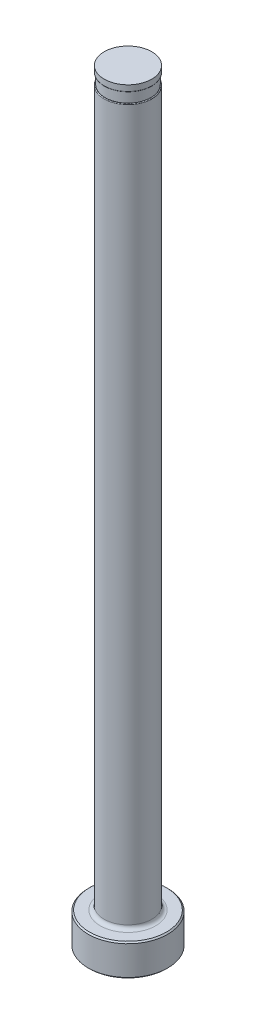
ISO-10303-21;
HEADER;
FILE_DESCRIPTION(('STEP AP214'),'2;1');
FILE_NAME('part.step','',(''),(''),'','','');
FILE_SCHEMA(('AUTOMOTIVE_DESIGN { 1 0 10303 214 1 1 1 1 }'));
ENDSEC;
DATA;
#1=APPLICATION_CONTEXT('core data for automotive mechanical design processes');
#2=APPLICATION_PROTOCOL_DEFINITION('international standard','automotive_design',2000,#1);
#3=PRODUCT_CONTEXT('',#1,'mechanical');
#4=PRODUCT('Part','Part','',(#3));
#5=PRODUCT_RELATED_PRODUCT_CATEGORY('part','',(#4));
#6=PRODUCT_DEFINITION_FORMATION('','',#4);
#7=PRODUCT_DEFINITION_CONTEXT('part definition',#1,'design');
#8=PRODUCT_DEFINITION('design','',#6,#7);
#9=PRODUCT_DEFINITION_SHAPE('','',#8);
#10=(LENGTH_UNIT() NAMED_UNIT(*) SI_UNIT(.MILLI.,.METRE.));
#11=(NAMED_UNIT(*) PLANE_ANGLE_UNIT() SI_UNIT($,.RADIAN.));
#12=(NAMED_UNIT(*) SI_UNIT($,.STERADIAN.) SOLID_ANGLE_UNIT());
#13=UNCERTAINTY_MEASURE_WITH_UNIT(LENGTH_MEASURE(1.E-05),#10,'distance_accuracy_value','');
#14=(GEOMETRIC_REPRESENTATION_CONTEXT(3) GLOBAL_UNCERTAINTY_ASSIGNED_CONTEXT((#13)) GLOBAL_UNIT_ASSIGNED_CONTEXT((#10,
#11,#12)) REPRESENTATION_CONTEXT('',''));
#15=CARTESIAN_POINT('',(0.,0.,0.));
#16=DIRECTION('',(0.,0.,1.));
#17=DIRECTION('',(1.,0.,0.));
#18=AXIS2_PLACEMENT_3D('',#15,#16,#17);
#19=CARTESIAN_POINT('',(-4.76249999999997,151.13,0.));
#20=DIRECTION('',(0.,1.,0.));
#21=DIRECTION('',(0.,0.,1.));
#22=AXIS2_PLACEMENT_3D('',#19,#20,#21);
#23=PLANE('',#22);
#24=CARTESIAN_POINT('',(0.,151.13,0.));
#25=DIRECTION('',(0.,1.,0.));
#26=DIRECTION('',(0.,0.,1.));
#27=AXIS2_PLACEMENT_3D('',#24,#25,#26);
#28=CIRCLE('',#27,4.62279999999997);
#29=CARTESIAN_POINT('',(0.,151.13,4.62279999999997));
#30=VERTEX_POINT('',#29);
#31=EDGE_CURVE('E11',#30,#30,#28,.F.);
#32=ORIENTED_EDGE('',*,*,#31,.T.);
#33=EDGE_LOOP('',(#32));
#34=FACE_BOUND('',#33,.T.);
#35=CARTESIAN_POINT('',(0.,151.13,0.));
#36=DIRECTION('',(0.,1.,0.));
#37=DIRECTION('',(0.,0.,1.));
#38=AXIS2_PLACEMENT_3D('',#35,#36,#37);
#39=CIRCLE('',#38,4.55929999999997);
#40=CARTESIAN_POINT('',(0.,151.13,4.55929999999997));
#41=VERTEX_POINT('',#40);
#42=EDGE_CURVE('E78',#41,#41,#39,.T.);
#43=ORIENTED_EDGE('',*,*,#42,.T.);
#44=EDGE_LOOP('',(#43));
#45=FACE_BOUND('',#44,.T.);
#46=ADVANCED_FACE('F36',(#34,#45),#23,.F.);
#47=CARTESIAN_POINT('',(0.,259.958771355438,0.));
#48=DIRECTION('',(0.,1.,0.));
#49=DIRECTION('',(0.,0.,1.));
#50=AXIS2_PLACEMENT_3D('',#47,#48,#49);
#51=CYLINDRICAL_SURFACE('',#50,4.76249999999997);
#52=DIRECTION('',(0.,1.,0.));
#53=VECTOR('',#52,1.);
#54=CARTESIAN_POINT('',(-4.55929999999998,259.958771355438,-1.37629566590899));
#55=LINE('',#54,#53);
#56=CARTESIAN_POINT('',(-4.55929999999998,148.971,-1.37629566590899));
#57=VERTEX_POINT('',#56);
#58=CARTESIAN_POINT('',(-4.55929999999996,86.614,-1.37629566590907));
#59=VERTEX_POINT('',#58);
#60=EDGE_CURVE('E73',#57,#59,#55,.F.);
#61=ORIENTED_EDGE('',*,*,#60,.F.);
#62=CARTESIAN_POINT('',(0.,148.971,0.));
#63=DIRECTION('',(0.,-1.,0.));
#64=DIRECTION('',(0.,0.,-1.));
#65=AXIS2_PLACEMENT_3D('',#62,#63,#64);
#66=CIRCLE('',#65,4.76249999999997);
#67=CARTESIAN_POINT('',(-4.55929999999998,148.971,1.37629566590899));
#68=VERTEX_POINT('',#67);
#69=EDGE_CURVE('E51',#57,#68,#66,.T.);
#70=ORIENTED_EDGE('',*,*,#69,.T.);
#71=DIRECTION('',(0.,1.,0.));
#72=VECTOR('',#71,1.);
#73=CARTESIAN_POINT('',(-4.55929999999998,259.958771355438,1.37629566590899));
#74=LINE('',#73,#72);
#75=CARTESIAN_POINT('',(-4.55929999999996,86.614,1.37629566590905));
#76=VERTEX_POINT('',#75);
#77=EDGE_CURVE('E84',#76,#68,#74,.T.);
#78=ORIENTED_EDGE('',*,*,#77,.F.);
#79=CARTESIAN_POINT('',(-4.55929999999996,86.614,-1.37629566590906));
#80=CARTESIAN_POINT('',(-4.55929737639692,86.5852402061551,-1.37629775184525));
#81=CARTESIAN_POINT('',(-4.55969127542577,86.5564975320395,-1.37500007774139));
#82=CARTESIAN_POINT('',(-4.56124470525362,86.4992773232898,-1.36984087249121));
#83=CARTESIAN_POINT('',(-4.5624038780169,86.4707996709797,-1.36598054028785));
#84=CARTESIAN_POINT('',(-4.56696801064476,86.3864539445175,-1.35067685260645));
#85=CARTESIAN_POINT('',(-4.5714603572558,86.3312762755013,-1.33550964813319));
#86=CARTESIAN_POINT('',(-4.58280020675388,86.2246988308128,-1.29605614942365));
#87=CARTESIAN_POINT('',(-4.58964466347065,86.1732942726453,-1.27178164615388));
#88=CARTESIAN_POINT('',(-4.60493832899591,86.0753127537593,-1.2152383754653));
#89=CARTESIAN_POINT('',(-4.61338924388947,86.0287410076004,-1.18296109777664));
#90=CARTESIAN_POINT('',(-4.63119432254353,85.9406407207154,-1.11122717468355));
#91=CARTESIAN_POINT('',(-4.64055936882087,85.8991909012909,-1.07167734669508));
#92=CARTESIAN_POINT('',(-4.65929799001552,85.8224511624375,-0.987030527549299));
#93=CARTESIAN_POINT('',(-4.66867156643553,85.7871627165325,-0.941932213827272));
#94=CARTESIAN_POINT('',(-4.68829944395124,85.7173161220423,-0.839298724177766));
#95=CARTESIAN_POINT('',(-4.69843056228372,85.6839130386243,-0.780955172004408));
#96=CARTESIAN_POINT('',(-4.71694909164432,85.6254876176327,-0.659965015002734));
#97=CARTESIAN_POINT('',(-4.72533534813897,85.6004708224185,-0.597315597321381));
#98=CARTESIAN_POINT('',(-4.74110178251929,85.5547147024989,-0.457354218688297));
#99=CARTESIAN_POINT('',(-4.74801655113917,85.5355974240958,-0.379457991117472));
#100=CARTESIAN_POINT('',(-4.75800499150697,85.5083334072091,-0.221524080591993));
#101=CARTESIAN_POINT('',(-4.76107621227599,85.500193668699,-0.141485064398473));
#102=CARTESIAN_POINT('',(-4.76327668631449,85.4943271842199,0.0299431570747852));
#103=CARTESIAN_POINT('',(-4.76181415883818,85.4981641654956,0.121398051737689));
#104=CARTESIAN_POINT('',(-4.75374911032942,85.5198915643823,0.302489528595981));
#105=CARTESIAN_POINT('',(-4.74714208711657,85.5377942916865,0.392124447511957));
#106=CARTESIAN_POINT('',(-4.72930079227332,85.5886459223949,0.568426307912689));
#107=CARTESIAN_POINT('',(-4.71798291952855,85.6218679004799,0.655007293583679));
#108=CARTESIAN_POINT('',(-4.69215822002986,85.7041393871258,0.819736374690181));
#109=CARTESIAN_POINT('',(-4.67765906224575,85.7531509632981,0.897904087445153));
#110=CARTESIAN_POINT('',(-4.65260917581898,85.8488873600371,1.01840460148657));
#111=CARTESIAN_POINT('',(-4.642278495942,85.8913315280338,1.06420330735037));
#112=CARTESIAN_POINT('',(-4.62221244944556,85.9833278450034,1.14822353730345));
#113=CARTESIAN_POINT('',(-4.61247679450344,86.0328765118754,1.18644875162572));
#114=CARTESIAN_POINT('',(-4.59462030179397,86.1386759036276,1.2538357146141));
#115=CARTESIAN_POINT('',(-4.58651300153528,86.1949770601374,1.28292253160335));
#116=CARTESIAN_POINT('',(-4.57311393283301,86.312357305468,1.3299034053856));
#117=CARTESIAN_POINT('',(-4.56781667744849,86.373426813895,1.34781928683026));
#118=CARTESIAN_POINT('',(-4.56265822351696,86.4650432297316,1.36513201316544));
#119=CARTESIAN_POINT('',(-4.5614036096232,86.4946738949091,1.36931216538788));
#120=CARTESIAN_POINT('',(-4.55972347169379,86.5541961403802,1.37489368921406));
#121=CARTESIAN_POINT('',(-4.55929732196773,86.584087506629,1.37629715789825));
#122=CARTESIAN_POINT('',(-4.55929999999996,86.614,1.37629566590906));
#123=B_SPLINE_CURVE_WITH_KNOTS('',3,(#79,#80,#81,#82,#83,#84,#85,#86,#87,#88,#89,#90,#91,#92,
#93,#94,#95,#96,#97,#98,#99,#100,#101,#102,#103,#104,#105,#106,#107,#108,#109,#110,#111,#112,
#113,#114,#115,#116,#117,#118,#119,#120,#121,#122),.UNSPECIFIED.,.F.,.F.,(4,2,2,2,2,2,2,2,2,2,2,
2,2,2,2,2,2,2,2,2,2,4),(0.,0.086214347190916,0.172388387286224,0.343564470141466,
0.514519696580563,0.685657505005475,0.859163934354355,1.03271180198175,1.23591349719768,
1.43924922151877,1.67981780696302,1.92053972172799,2.1939427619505,2.4675853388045,
2.74630643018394,3.02436286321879,3.21350217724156,3.40254910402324,3.59310796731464,
3.78329335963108,3.87302183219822,3.9626825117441),.UNSPECIFIED.);
#124=EDGE_CURVE('E81',#59,#76,#123,.T.);
#125=ORIENTED_EDGE('',*,*,#124,.F.);
#126=EDGE_LOOP('',(#61,#70,#78,#125));
#127=FACE_BOUND('',#126,.T.);
#128=CARTESIAN_POINT('',(0.,7.11200000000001,0.));
#129=DIRECTION('',(0.,1.,0.));
#130=DIRECTION('',(0.,0.,1.));
#131=AXIS2_PLACEMENT_3D('',#128,#129,#130);
#132=CIRCLE('',#131,4.76249999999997);
#133=CARTESIAN_POINT('',(0.,7.11200000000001,4.76249999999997));
#134=VERTEX_POINT('',#133);
#135=EDGE_CURVE('E116',#134,#134,#132,.T.);
#136=ORIENTED_EDGE('',*,*,#135,.T.);
#137=EDGE_LOOP('',(#136));
#138=FACE_BOUND('',#137,.T.);
#139=ADVANCED_FACE('F82',(#127,#138),#51,.T.);
#140=CARTESIAN_POINT('',(0.,0.,0.));
#141=DIRECTION('',(0.,-1.,0.));
#142=DIRECTION('',(0.,0.,-1.));
#143=AXIS2_PLACEMENT_3D('',#140,#141,#142);
#144=PLANE('',#143);
#145=CARTESIAN_POINT('',(0.,0.,0.));
#146=DIRECTION('',(0.,-1.,0.));
#147=DIRECTION('',(0.,0.,-1.));
#148=AXIS2_PLACEMENT_3D('',#145,#146,#147);
#149=CIRCLE('',#148,7.68349999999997);
#150=CARTESIAN_POINT('',(0.,0.,-7.68349999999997));
#151=VERTEX_POINT('',#150);
#152=EDGE_CURVE('E113',#151,#151,#149,.T.);
#153=ORIENTED_EDGE('',*,*,#152,.T.);
#154=EDGE_LOOP('',(#153));
#155=FACE_BOUND('',#154,.T.);
#156=ADVANCED_FACE('F192',(#155),#144,.T.);
#157=CARTESIAN_POINT('',(0.,259.958771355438,0.));
#158=DIRECTION('',(0.,1.,0.));
#159=DIRECTION('',(0.,0.,1.));
#160=AXIS2_PLACEMENT_3D('',#157,#158,#159);
#161=CYLINDRICAL_SURFACE('',#160,7.93749999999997);
#162=CARTESIAN_POINT('',(0.,6.09600000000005,0.));
#163=DIRECTION('',(0.,1.,0.));
#164=DIRECTION('',(0.,0.,1.));
#165=AXIS2_PLACEMENT_3D('',#162,#163,#164);
#166=CIRCLE('',#165,7.93749999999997);
#167=CARTESIAN_POINT('',(0.,6.09600000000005,7.93749999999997));
#168=VERTEX_POINT('',#167);
#169=EDGE_CURVE('E110',#168,#168,#166,.F.);
#170=ORIENTED_EDGE('',*,*,#169,.T.);
#171=EDGE_LOOP('',(#170));
#172=FACE_BOUND('',#171,.T.);
#173=CARTESIAN_POINT('',(0.,0.253999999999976,0.));
#174=DIRECTION('',(0.,-1.,0.));
#175=DIRECTION('',(0.,0.,-1.));
#176=AXIS2_PLACEMENT_3D('',#173,#174,#175);
#177=CIRCLE('',#176,7.93749999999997);
#178=CARTESIAN_POINT('',(0.,0.253999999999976,-7.93749999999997));
#179=VERTEX_POINT('',#178);
#180=EDGE_CURVE('E107',#179,#179,#177,.F.);
#181=ORIENTED_EDGE('',*,*,#180,.T.);
#182=EDGE_LOOP('',(#181));
#183=FACE_BOUND('',#182,.T.);
#184=ADVANCED_FACE('F195',(#172,#183),#161,.T.);
#185=CARTESIAN_POINT('',(-7.93749999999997,6.35,0.));
#186=DIRECTION('',(0.,1.,0.));
#187=DIRECTION('',(0.,0.,1.));
#188=AXIS2_PLACEMENT_3D('',#185,#186,#187);
#189=PLANE('',#188);
#190=CARTESIAN_POINT('',(0.,6.35,0.));
#191=DIRECTION('',(0.,1.,0.));
#192=DIRECTION('',(0.,0.,1.));
#193=AXIS2_PLACEMENT_3D('',#190,#191,#192);
#194=CIRCLE('',#193,5.52449999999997);
#195=CARTESIAN_POINT('',(0.,6.35,5.52449999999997));
#196=VERTEX_POINT('',#195);
#197=EDGE_CURVE('E87',#196,#196,#194,.F.);
#198=ORIENTED_EDGE('',*,*,#197,.T.);
#199=EDGE_LOOP('',(#198));
#200=FACE_BOUND('',#199,.T.);
#201=CARTESIAN_POINT('',(0.,6.35,0.));
#202=DIRECTION('',(0.,1.,0.));
#203=DIRECTION('',(0.,0.,1.));
#204=AXIS2_PLACEMENT_3D('',#201,#202,#203);
#205=CIRCLE('',#204,7.68350000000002);
#206=CARTESIAN_POINT('',(0.,6.35,7.68350000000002));
#207=VERTEX_POINT('',#206);
#208=EDGE_CURVE('E104',#207,#207,#205,.T.);
#209=ORIENTED_EDGE('',*,*,#208,.T.);
#210=EDGE_LOOP('',(#209));
#211=FACE_BOUND('',#210,.T.);
#212=ADVANCED_FACE('F190',(#200,#211),#189,.T.);
#213=CARTESIAN_POINT('',(0.,6.35000000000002,0.));
#214=DIRECTION('',(0.,-1.,0.));
#215=DIRECTION('',(0.,0.,-1.));
#216=AXIS2_PLACEMENT_3D('',#213,#214,#215);
#217=CONICAL_SURFACE('',#216,7.6835,0.785398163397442);
#218=ORIENTED_EDGE('',*,*,#169,.F.);
#219=EDGE_LOOP('',(#218));
#220=FACE_BOUND('',#219,.T.);
#221=ORIENTED_EDGE('',*,*,#208,.F.);
#222=EDGE_LOOP('',(#221));
#223=FACE_BOUND('',#222,.T.);
#224=ADVANCED_FACE('F186',(#220,#223),#217,.T.);
#225=CARTESIAN_POINT('',(0.,0.253999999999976,0.));
#226=DIRECTION('',(0.,1.,0.));
#227=DIRECTION('',(0.,0.,1.));
#228=AXIS2_PLACEMENT_3D('',#225,#226,#227);
#229=CONICAL_SURFACE('',#228,7.93749999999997,0.785398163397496);
#230=ORIENTED_EDGE('',*,*,#152,.F.);
#231=EDGE_LOOP('',(#230));
#232=FACE_BOUND('',#231,.T.);
#233=ORIENTED_EDGE('',*,*,#180,.F.);
#234=EDGE_LOOP('',(#233));
#235=FACE_BOUND('',#234,.T.);
#236=ADVANCED_FACE('F182',(#232,#235),#229,.T.);
#237=CARTESIAN_POINT('',(0.,7.11200000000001,0.));
#238=DIRECTION('',(0.,1.,0.));
#239=DIRECTION('',(0.,0.,1.));
#240=AXIS2_PLACEMENT_3D('',#237,#238,#239);
#241=TOROIDAL_SURFACE('',#240,5.52449999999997,0.762);
#242=ORIENTED_EDGE('',*,*,#197,.F.);
#243=EDGE_LOOP('',(#242));
#244=FACE_BOUND('',#243,.T.);
#245=ORIENTED_EDGE('',*,*,#135,.F.);
#246=EDGE_LOOP('',(#245));
#247=FACE_BOUND('',#246,.T.);
#248=ADVANCED_FACE('F147',(#244,#247),#241,.F.);
#249=CARTESIAN_POINT('',(-4.76249999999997,149.098,0.));
#250=DIRECTION('',(0.,-1.,0.));
#251=DIRECTION('',(0.,0.,-1.));
#252=AXIS2_PLACEMENT_3D('',#249,#250,#251);
#253=PLANE('',#252);
#254=DIRECTION('',(0.,0.,1.));
#255=VECTOR('',#254,1.);
#256=CARTESIAN_POINT('',(-4.55929999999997,149.098,0.));
#257=LINE('',#256,#255);
#258=CARTESIAN_POINT('',(-4.55929999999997,149.098,0.));
#259=VERTEX_POINT('',#258);
#260=CARTESIAN_POINT('',(-4.55929999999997,149.098,0.837044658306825));
#261=VERTEX_POINT('',#260);
#262=EDGE_CURVE('E90',#259,#261,#257,.T.);
#263=ORIENTED_EDGE('',*,*,#262,.T.);
#264=CARTESIAN_POINT('',(0.,149.098,0.));
#265=DIRECTION('',(0.,-1.,0.));
#266=DIRECTION('',(0.,0.,-1.));
#267=AXIS2_PLACEMENT_3D('',#264,#265,#266);
#268=CIRCLE('',#267,4.63549999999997);
#269=CARTESIAN_POINT('',(-4.55929999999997,149.098,-0.837044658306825));
#270=VERTEX_POINT('',#269);
#271=EDGE_CURVE('E86',#261,#270,#268,.F.);
#272=ORIENTED_EDGE('',*,*,#271,.T.);
#273=EDGE_CURVE('E79',#270,#259,#257,.T.);
#274=ORIENTED_EDGE('',*,*,#273,.T.);
#275=CARTESIAN_POINT('',(0.,149.098,0.));
#276=DIRECTION('',(0.,1.,0.));
#277=DIRECTION('',(0.,0.,1.));
#278=AXIS2_PLACEMENT_3D('',#275,#276,#277);
#279=CIRCLE('',#278,4.55929999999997);
#280=EDGE_CURVE('E101',#259,#259,#279,.T.);
#281=ORIENTED_EDGE('',*,*,#280,.F.);
#282=EDGE_LOOP('',(#263,#272,#274,#281));
#283=FACE_BOUND('',#282,.T.);
#284=ADVANCED_FACE('F144',(#283),#253,.F.);
#285=CARTESIAN_POINT('',(0.,153.448281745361,0.));
#286=DIRECTION('',(0.,1.,0.));
#287=DIRECTION('',(0.,0.,1.));
#288=AXIS2_PLACEMENT_3D('',#285,#286,#287);
#289=CYLINDRICAL_SURFACE('',#288,4.55929999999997);
#290=ORIENTED_EDGE('',*,*,#42,.F.);
#291=EDGE_LOOP('',(#290));
#292=FACE_BOUND('',#291,.T.);
#293=ORIENTED_EDGE('',*,*,#280,.T.);
#294=EDGE_LOOP('',(#293));
#295=FACE_BOUND('',#294,.T.);
#296=ADVANCED_FACE('F141',(#292,#295),#289,.T.);
#297=CARTESIAN_POINT('',(-4.55929999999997,150.114,-7.93749999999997));
#298=DIRECTION('',(1.,0.,0.));
#299=DIRECTION('',(0.,1.,0.));
#300=AXIS2_PLACEMENT_3D('',#297,#298,#299);
#301=PLANE('',#300);
#302=ORIENTED_EDGE('',*,*,#273,.F.);
#303=CARTESIAN_POINT('',(-4.55929999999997,149.098,-0.837044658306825));
#304=CARTESIAN_POINT('',(-4.55929999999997,149.097996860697,-0.858041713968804));
#305=CARTESIAN_POINT('',(-4.55929999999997,149.097829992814,-0.879040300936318));
#306=CARTESIAN_POINT('',(-4.55929999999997,149.097073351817,-0.921044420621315));
#307=CARTESIAN_POINT('',(-4.55929999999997,149.096483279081,-0.942049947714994));
#308=CARTESIAN_POINT('',(-4.55929999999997,149.094769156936,-0.984421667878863));
#309=CARTESIAN_POINT('',(-4.55929999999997,149.093635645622,-1.00578751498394));
#310=CARTESIAN_POINT('',(-4.55929999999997,149.090687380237,-1.04846310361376));
#311=CARTESIAN_POINT('',(-4.55929999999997,149.088872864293,-1.06977286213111));
#312=CARTESIAN_POINT('',(-4.55929999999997,149.083360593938,-1.12201635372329));
#313=CARTESIAN_POINT('',(-4.55929999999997,149.079181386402,-1.15290757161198));
#314=CARTESIAN_POINT('',(-4.55929999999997,149.070757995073,-1.19875333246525));
#315=CARTESIAN_POINT('',(-4.55929999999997,149.067604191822,-1.21390713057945));
#316=CARTESIAN_POINT('',(-4.55929999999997,149.06032624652,-1.24397628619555));
#317=CARTESIAN_POINT('',(-4.55929999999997,149.056203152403,-1.25889188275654));
#318=CARTESIAN_POINT('',(-4.55929999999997,149.049136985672,-1.28034672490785));
#319=CARTESIAN_POINT('',(-4.55929999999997,149.046754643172,-1.28707008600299));
#320=CARTESIAN_POINT('',(-4.55929999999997,149.041598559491,-1.30038917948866));
#321=CARTESIAN_POINT('',(-4.55929999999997,149.038823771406,-1.30698451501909));
#322=CARTESIAN_POINT('',(-4.55929999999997,149.032425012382,-1.32070015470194));
#323=CARTESIAN_POINT('',(-4.55929999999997,149.028739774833,-1.32779211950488));
#324=CARTESIAN_POINT('',(-4.55929999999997,149.020505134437,-1.34145187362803));
#325=CARTESIAN_POINT('',(-4.55929999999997,149.015959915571,-1.34802199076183));
#326=CARTESIAN_POINT('',(-4.55929999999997,149.008707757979,-1.3564128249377));
#327=CARTESIAN_POINT('',(-4.55929999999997,149.006550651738,-1.35870356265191));
#328=CARTESIAN_POINT('',(-4.55929999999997,149.001986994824,-1.36303580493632));
#329=CARTESIAN_POINT('',(-4.55929999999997,148.999580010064,-1.36507686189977));
#330=CARTESIAN_POINT('',(-4.55929999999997,148.994447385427,-1.36882028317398));
#331=CARTESIAN_POINT('',(-4.55929999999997,148.99171711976,-1.37051646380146));
#332=CARTESIAN_POINT('',(-4.55929999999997,148.985982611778,-1.37333747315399));
#333=CARTESIAN_POINT('',(-4.55929999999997,148.982980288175,-1.37446598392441));
#334=CARTESIAN_POINT('',(-4.55929999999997,148.978439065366,-1.37556999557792));
#335=CARTESIAN_POINT('',(-4.55929999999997,148.976969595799,-1.37583954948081));
#336=CARTESIAN_POINT('',(-4.55929999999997,148.974000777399,-1.37620343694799));
#337=CARTESIAN_POINT('',(-4.55929999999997,148.972501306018,-1.3762967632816));
#338=CARTESIAN_POINT('',(-4.55929999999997,148.971,-1.37629566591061));
#339=B_SPLINE_CURVE_WITH_KNOTS('',3,(#303,#304,#305,#306,#307,#308,#309,#310,#311,#312,#313,
#314,#315,#316,#317,#318,#319,#320,#321,#322,#323,#324,#325,#326,#327,#328,#329,#330,#331,#332,
#333,#334,#335,#336,#337,#338),.UNSPECIFIED.,.F.,.F.,(4,2,2,2,2,2,2,2,2,2,2,2,2,2,2,2,2,4),(0.,
0.0629926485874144,0.126029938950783,0.190207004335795,0.254361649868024,0.347770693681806,
0.394187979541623,0.440555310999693,0.461946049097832,0.483394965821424,0.507342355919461,
0.531176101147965,0.540601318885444,0.550043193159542,0.559641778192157,0.56917727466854,
0.573649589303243,0.578147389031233),.UNSPECIFIED.);
#340=EDGE_CURVE('E59',#270,#57,#339,.T.);
#341=ORIENTED_EDGE('',*,*,#340,.T.);
#342=ORIENTED_EDGE('',*,*,#60,.T.);
#343=DIRECTION('',(0.,0.,1.));
#344=VECTOR('',#343,1.);
#345=CARTESIAN_POINT('',(-4.55929999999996,86.614,-7.93749999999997));
#346=LINE('',#345,#344);
#347=EDGE_CURVE('E77',#59,#76,#346,.T.);
#348=ORIENTED_EDGE('',*,*,#347,.T.);
#349=ORIENTED_EDGE('',*,*,#77,.T.);
#350=CARTESIAN_POINT('',(-4.55929999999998,148.971,1.37629566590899));
#351=CARTESIAN_POINT('',(-4.55929999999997,148.973444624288,1.3763038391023));
#352=CARTESIAN_POINT('',(-4.55929999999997,148.975877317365,1.37605183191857));
#353=CARTESIAN_POINT('',(-4.55929999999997,148.980619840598,1.37510642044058));
#354=CARTESIAN_POINT('',(-4.55929999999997,148.982930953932,1.37441958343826));
#355=CARTESIAN_POINT('',(-4.55929999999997,148.987943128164,1.37247105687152));
#356=CARTESIAN_POINT('',(-4.55929999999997,148.990605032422,1.3711110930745));
#357=CARTESIAN_POINT('',(-4.55929999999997,148.995689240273,1.36798215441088));
#358=CARTESIAN_POINT('',(-4.55929999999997,148.998109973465,1.36621072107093));
#359=CARTESIAN_POINT('',(-4.55929999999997,149.004401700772,1.36098866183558));
#360=CARTESIAN_POINT('',(-4.55929999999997,149.0080371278,1.35725807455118));
#361=CARTESIAN_POINT('',(-4.55929999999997,149.014750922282,1.34933701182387));
#362=CARTESIAN_POINT('',(-4.55929999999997,149.017828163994,1.34514563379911));
#363=CARTESIAN_POINT('',(-4.55929999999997,149.029141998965,1.32813171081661));
#364=CARTESIAN_POINT('',(-4.55929999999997,149.035833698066,1.31430846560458));
#365=CARTESIAN_POINT('',(-4.55929999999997,149.047426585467,1.28593719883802));
#366=CARTESIAN_POINT('',(-4.55929999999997,149.052315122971,1.27138484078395));
#367=CARTESIAN_POINT('',(-4.55929999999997,149.060580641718,1.24300288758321));
#368=CARTESIAN_POINT('',(-4.55929999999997,149.064042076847,1.22919836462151));
#369=CARTESIAN_POINT('',(-4.55929999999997,149.070216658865,1.20142059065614));
#370=CARTESIAN_POINT('',(-4.55929999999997,149.072929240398,1.18744722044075));
#371=CARTESIAN_POINT('',(-4.55929999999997,149.080216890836,1.14532367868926));
#372=CARTESIAN_POINT('',(-4.55929999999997,149.08392779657,1.11702450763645));
#373=CARTESIAN_POINT('',(-4.55929999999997,149.089831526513,1.06027711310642));
#374=CARTESIAN_POINT('',(-4.55929999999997,149.092023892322,1.031828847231));
#375=CARTESIAN_POINT('',(-4.55929999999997,149.095305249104,0.974900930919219));
#376=CARTESIAN_POINT('',(-4.55929999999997,149.096395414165,0.946421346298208));
#377=CARTESIAN_POINT('',(-4.55929999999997,149.097399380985,0.904435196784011));
#378=CARTESIAN_POINT('',(-4.55929999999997,149.097630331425,0.890934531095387));
#379=CARTESIAN_POINT('',(-4.55929999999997,149.097930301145,0.863970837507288));
#380=CARTESIAN_POINT('',(-4.55929999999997,149.097999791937,0.85050781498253));
#381=CARTESIAN_POINT('',(-4.55929999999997,149.098,0.837044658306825));
#382=B_SPLINE_CURVE_WITH_KNOTS('',3,(#350,#351,#352,#353,#354,#355,#356,#357,#358,#359,#360,
#361,#362,#363,#364,#365,#366,#367,#368,#369,#370,#371,#372,#373,#374,#375,#376,#377,#378,#379,
#380,#381),.UNSPECIFIED.,.F.,.F.,(4,2,2,2,2,2,2,2,2,2,2,2,2,2,2,4),(0.,0.00730179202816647,
0.0144958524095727,0.0234127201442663,0.0323843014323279,0.0479233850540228,0.0634934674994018,
0.109206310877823,0.155234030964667,0.197892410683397,0.240582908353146,0.32613198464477,
0.411706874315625,0.497190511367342,0.537697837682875,0.578086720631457),.UNSPECIFIED.);
#383=EDGE_CURVE('E172',#68,#261,#382,.T.);
#384=ORIENTED_EDGE('',*,*,#383,.T.);
#385=ORIENTED_EDGE('',*,*,#262,.F.);
#386=EDGE_LOOP('',(#302,#341,#342,#348,#349,#384,#385));
#387=FACE_BOUND('',#386,.T.);
#388=ADVANCED_FACE('F75',(#387),#301,.F.);
#389=CARTESIAN_POINT('',(-7.73429999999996,86.614,-7.93749999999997));
#390=DIRECTION('',(0.,0.,1.));
#391=DIRECTION('',(1.,0.,0.));
#392=AXIS2_PLACEMENT_3D('',#389,#390,#391);
#393=CYLINDRICAL_SURFACE('',#392,3.175);
#394=ORIENTED_EDGE('',*,*,#347,.F.);
#395=ORIENTED_EDGE('',*,*,#124,.T.);
#396=EDGE_LOOP('',(#394,#395));
#397=FACE_BOUND('',#396,.T.);
#398=ADVANCED_FACE('F89',(#397),#393,.F.);
#399=CARTESIAN_POINT('',(0.,152.687735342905,0.));
#400=DIRECTION('',(0.,1.,0.));
#401=DIRECTION('',(0.,0.,1.));
#402=AXIS2_PLACEMENT_3D('',#399,#400,#401);
#403=CYLINDRICAL_SURFACE('',#402,4.74979999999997);
#404=CARTESIAN_POINT('',(0.,151.257,0.));
#405=DIRECTION('',(0.,1.,0.));
#406=DIRECTION('',(0.,0.,1.));
#407=AXIS2_PLACEMENT_3D('',#404,#405,#406);
#408=CIRCLE('',#407,4.74979999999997);
#409=CARTESIAN_POINT('',(0.,151.257,4.74979999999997));
#410=VERTEX_POINT('',#409);
#411=EDGE_CURVE('E44',#410,#410,#408,.T.);
#412=ORIENTED_EDGE('',*,*,#411,.T.);
#413=EDGE_LOOP('',(#412));
#414=FACE_BOUND('',#413,.T.);
#415=CARTESIAN_POINT('',(0.,152.4,0.));
#416=DIRECTION('',(0.,1.,0.));
#417=DIRECTION('',(0.,0.,1.));
#418=AXIS2_PLACEMENT_3D('',#415,#416,#417);
#419=CIRCLE('',#418,4.74979999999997);
#420=CARTESIAN_POINT('',(0.,152.4,4.74979999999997));
#421=VERTEX_POINT('',#420);
#422=EDGE_CURVE('E91',#421,#421,#419,.T.);
#423=ORIENTED_EDGE('',*,*,#422,.F.);
#424=EDGE_LOOP('',(#423));
#425=FACE_BOUND('',#424,.T.);
#426=ADVANCED_FACE('F135',(#414,#425),#403,.T.);
#427=CARTESIAN_POINT('',(-4.76249999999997,152.4,0.));
#428=DIRECTION('',(0.,1.,0.));
#429=DIRECTION('',(0.,0.,1.));
#430=AXIS2_PLACEMENT_3D('',#427,#428,#429);
#431=PLANE('',#430);
#432=ORIENTED_EDGE('',*,*,#422,.T.);
#433=EDGE_LOOP('',(#432));
#434=FACE_BOUND('',#433,.T.);
#435=ADVANCED_FACE('F149',(#434),#431,.T.);
#436=CARTESIAN_POINT('',(0.,148.971,0.));
#437=DIRECTION('',(0.,-1.,0.));
#438=DIRECTION('',(0.,0.,-1.));
#439=AXIS2_PLACEMENT_3D('',#436,#437,#438);
#440=TOROIDAL_SURFACE('',#439,4.63549999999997,0.127);
#441=ORIENTED_EDGE('',*,*,#383,.F.);
#442=ORIENTED_EDGE('',*,*,#69,.F.);
#443=ORIENTED_EDGE('',*,*,#340,.F.);
#444=ORIENTED_EDGE('',*,*,#271,.F.);
#445=EDGE_LOOP('',(#441,#442,#443,#444));
#446=FACE_BOUND('',#445,.T.);
#447=ADVANCED_FACE('F151',(#446),#440,.T.);
#448=CARTESIAN_POINT('',(0.,151.257,0.));
#449=DIRECTION('',(0.,1.,0.));
#450=DIRECTION('',(0.,0.,1.));
#451=AXIS2_PLACEMENT_3D('',#448,#449,#450);
#452=TOROIDAL_SURFACE('',#451,4.62279999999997,0.127);
#453=ORIENTED_EDGE('',*,*,#31,.F.);
#454=EDGE_LOOP('',(#453));
#455=FACE_BOUND('',#454,.T.);
#456=ORIENTED_EDGE('',*,*,#411,.F.);
#457=EDGE_LOOP('',(#456));
#458=FACE_BOUND('',#457,.T.);
#459=ADVANCED_FACE('F38',(#455,#458),#452,.T.);
#460=CLOSED_SHELL('',(#46,#139,#156,#184,#212,#224,#236,#248,#284,#296,#388,#398,#426,#435,#447,#459));
#461=MANIFOLD_SOLID_BREP('B2',#460);
#462=ADVANCED_BREP_SHAPE_REPRESENTATION('',(#18,#461),#14);
#463=SHAPE_DEFINITION_REPRESENTATION(#9,#462);
ENDSEC;
END-ISO-10303-21;
